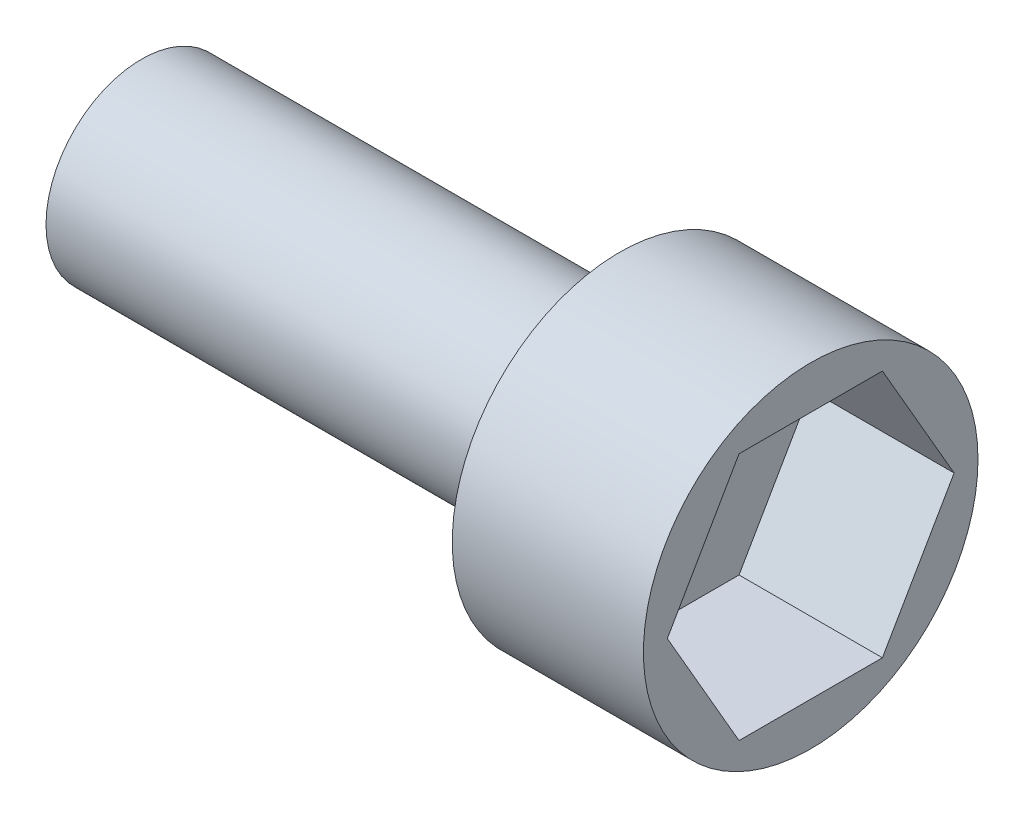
from build123d import *

# Parameters (mm, degrees)
SKETCH1_R           = 2
BOSS_EXTRUDE1_DEPTH = 10
SKETCH2_R           = 3.5
BOSS_EXTRUDE2_DEPTH = 4
CUT_EXTRUDE1_DEPTH  = 3


with BuildPart() as part:
    # Sketch1 → Boss-Extrude1 (new body)
    with BuildSketch(Plane(origin=(0, 0, 0), x_dir=(0, 0, -1), z_dir=(1, 0, 0))):
        Circle(SKETCH1_R)
    extrude(amount=BOSS_EXTRUDE1_DEPTH)

    # Sketch2 → Boss-Extrude2 (add)
    with BuildSketch(Plane(origin=(10, 0, 0), x_dir=(0, 0, -1), z_dir=(1, 0, 0))):
        Circle(SKETCH2_R)
    extrude(amount=BOSS_EXTRUDE2_DEPTH)

    # Sketch3 → Cut-Extrude1 (cut)
    with BuildSketch(Plane(origin=(14, 0, 0), x_dir=(0, 0, -1), z_dir=(1, 0, 0))):
        Polygon((-3, 0), (-1.5, -2.598076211), (1.5, -2.598076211), (3, 0), (1.5, 2.598076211), (-1.5, 2.598076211), align=None)
    extrude(amount=-CUT_EXTRUDE1_DEPTH, mode=Mode.SUBTRACT)


solid = part.part
